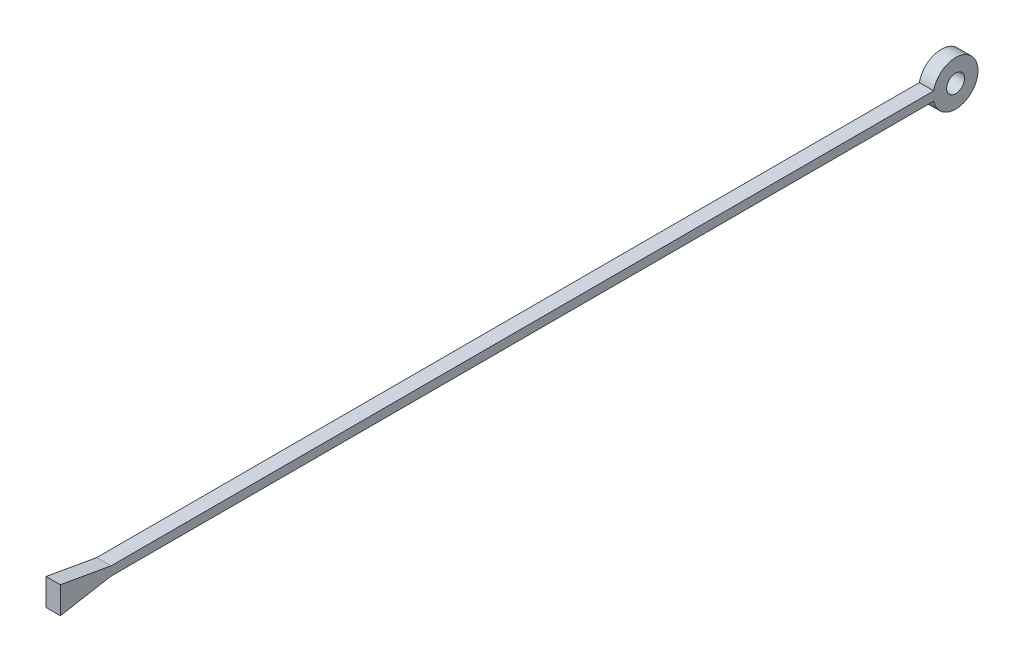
from build123d import *

# Parameters (mm, degrees)
SKETCH1_R           = 5
BOSS_EXTRUDE1_DEPTH = 8


with BuildPart() as part:
    # Sketch1 → Boss-Extrude1 (new body)
    with BuildSketch(Plane(origin=(0, 0, 0), x_dir=(0, 0, -1), z_dir=(1, 0, 0))):
        with BuildLine():
            Line((-500, 7.5), (-500, -7.5))
            Line((-500, -7.5), (-471.643590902, -2.5))
            Line((-471.643590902, -2.5), (-12.247448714, -2.5))
            ThreePointArc((-12.247448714, -2.5), (12.5, 0), (-12.247448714, 2.5))
            Line((-12.247448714, 2.5), (-471.643590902, 2.5))
            Line((-471.643590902, 2.5), (-500, 7.5))
        make_face()
        Circle(SKETCH1_R, mode=Mode.SUBTRACT)
    extrude(amount=BOSS_EXTRUDE1_DEPTH)


solid = part.part
